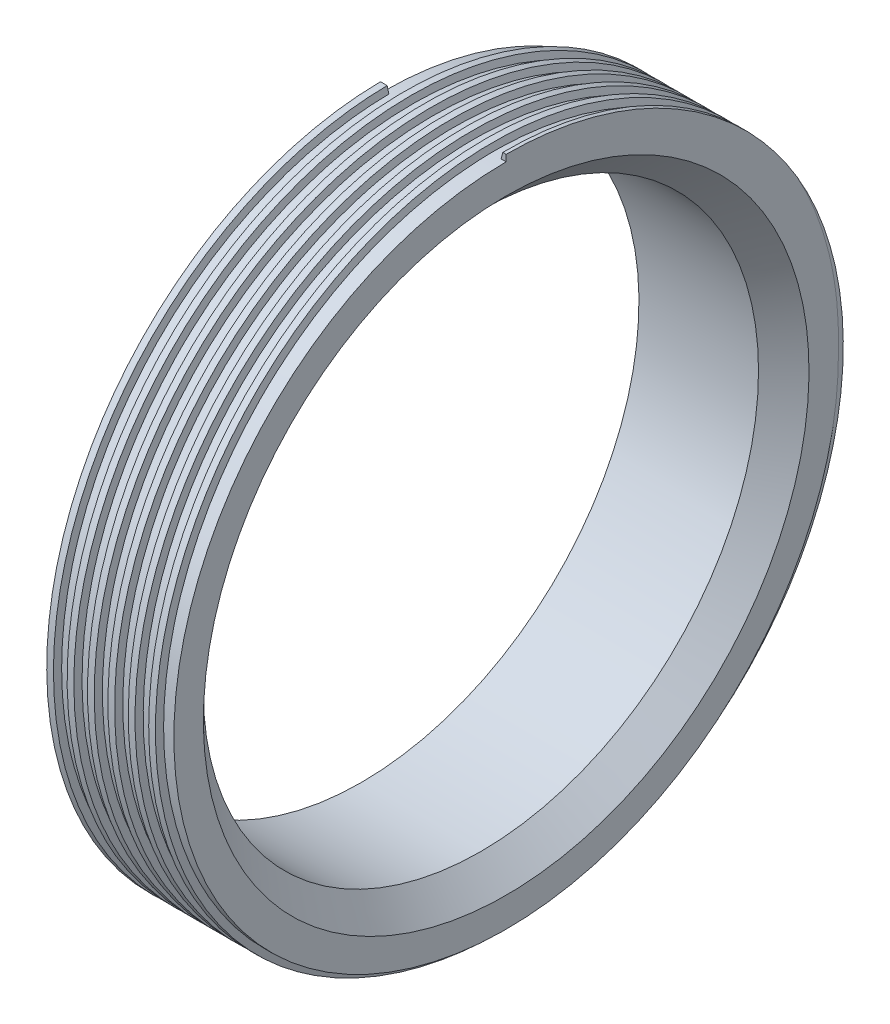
from build123d import *

# Parameters (mm, degrees)
SKETCH10_OUTSIDE_W  = 154.876
SKETCH10_OUTSIDE_H  = 154.876
SKETCH10_OUTSIDE_R  = 58.293
CUT_EXTRUDE14_DEPTH = 21.463
SWEEP1_PITCH        = 3.577166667
SWEEP1_HEIGHT       = 21.463
SWEEP1_RADIUS       = 59.436
SWEEP1_START_ANGLE  = -90
SKETCH16_R          = 48.6918
CUT_EXTRUDE16_DEPTH = 33.3248
CHAMFER1_SIZE       = 4.42976
SKETCH17_W          = 32.482596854
SKETCH17_H          = 125.576024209
CUT_EXTRUDE17_DEPTH = 63.5


with BuildPart() as part:
    # Sketch1 → Revolve1 (revolve)
    with BuildSketch(Plane.XY):
        with BuildLine():
            Line((0, 0), (0, 50.8))
            Line((0, 50.8), (0.762, 50.8))
            ThreePointArc((0.762, 50.8), (3.00706403, 51.72993597), (3.937, 53.975))
            Line((3.937, 53.975), (3.937, 59.436))
            Line((3.937, 59.436), (25.4, 59.436))
            Line((25.4, 59.436), (25.4, 0))
            Line((25.4, 0), (0, 0))
        make_face()
    revolve(axis=Axis((25.4, 0, 0), (-1, 0, 0)))

    # Sketch10 outside → Cut-Extrude14 (cut)
    with BuildSketch(Plane(origin=(25.4, 0, 0), x_dir=(0, 0, -1), z_dir=(1, 0, 0))):
        Rectangle(SKETCH10_OUTSIDE_W, SKETCH10_OUTSIDE_H)
        with Locations(Location((0, 0, 0), (0, 0, 90))):
            Circle(SKETCH10_OUTSIDE_R, mode=Mode.SUBTRACT)
    extrude(amount=-CUT_EXTRUDE14_DEPTH, mode=Mode.SUBTRACT)

    # Sweep1: sweep along a helix
    with BuildLine() as sweep1_path:
        add(Helix(SWEEP1_PITCH, SWEEP1_HEIGHT, SWEEP1_RADIUS, center=(25.4, 0, 0), direction=(-1, 0, 0), mode=Mode.PRIVATE).rotate(Axis((25.4, 0, 0), (-1, 0, 0)), SWEEP1_START_ANGLE))
    # Sketch13 → Sweep1 (sweep)
    with BuildSketch(Plane(origin=(0, 0, 0), x_dir=(1, 0, 0), z_dir=(0, 1, 0))):
        Polygon((20.34053176, 59.435878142), (21.51655176, 59.435878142), (21.992796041, 57.594378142), (19.864287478, 57.594378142), align=None)
    sweep(path=sweep1_path.line, is_frenet=True)

    # Sketch16 → Cut-Extrude16 (cut)
    with BuildSketch(Plane.ZY):
        with Locations(Location((0, 0, 0), (0, 0, 270))):
            Circle(SKETCH16_R)
    extrude(amount=-CUT_EXTRUDE16_DEPTH, mode=Mode.SUBTRACT)

    # Chamfer1
    chamfer1_edges = [part.edges().sort_by_distance(p)[0] for p in [
        (25.4, 48.6918, 0),
    ]]
    chamfer(chamfer1_edges, length=CHAMFER1_SIZE)

    # Sketch17 → Cut-Extrude17 (cut, symmetric)
    with BuildSketch(Plane.XY):
        with Locations((41.641298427, 4.495012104)):
            Rectangle(SKETCH17_W, SKETCH17_H)
    extrude(amount=CUT_EXTRUDE17_DEPTH, both=True, mode=Mode.SUBTRACT)


solid = part.part
